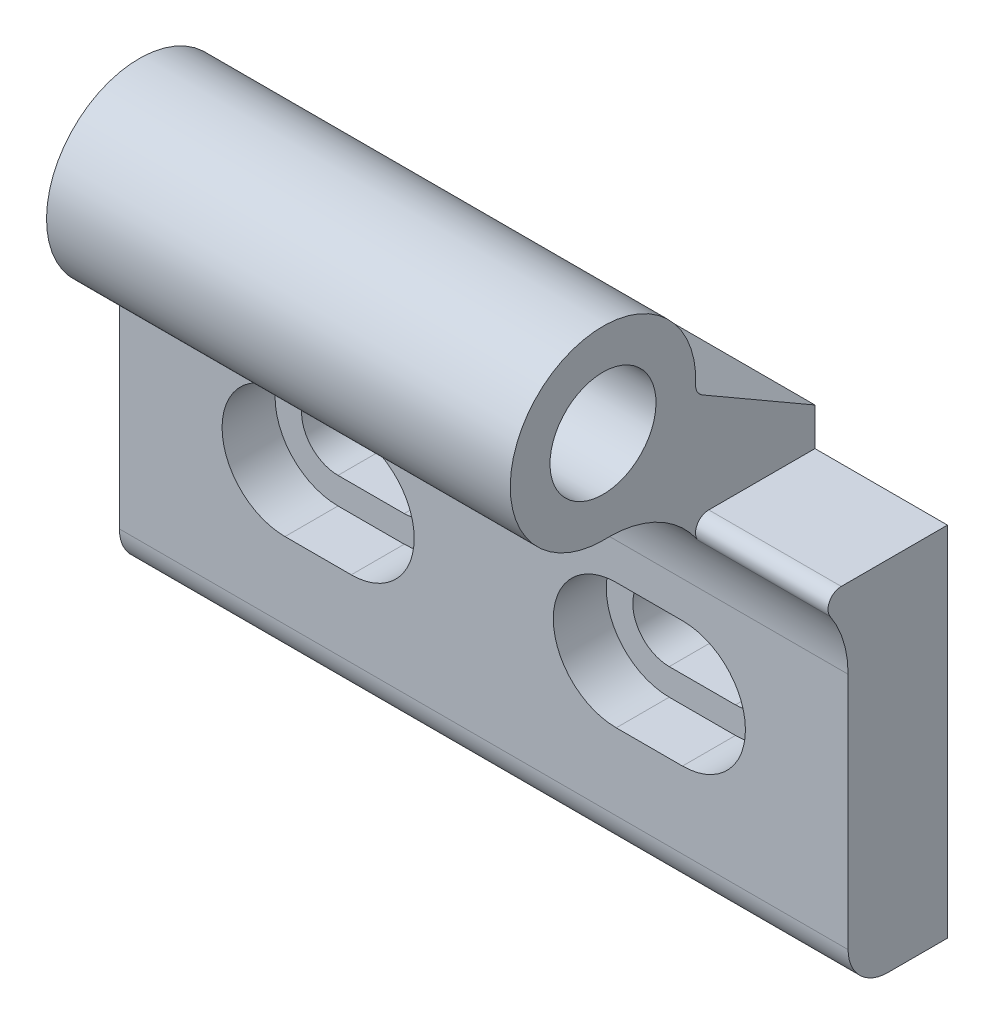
ISO-10303-21;
HEADER;
FILE_DESCRIPTION(('STEP AP214'),'2;1');
FILE_NAME('part.step','',(''),(''),'','','');
FILE_SCHEMA(('AUTOMOTIVE_DESIGN { 1 0 10303 214 1 1 1 1 }'));
ENDSEC;
DATA;
#1=APPLICATION_CONTEXT('core data for automotive mechanical design processes');
#2=APPLICATION_PROTOCOL_DEFINITION('international standard','automotive_design',2000,#1);
#3=PRODUCT_CONTEXT('',#1,'mechanical');
#4=PRODUCT('Part','Part','',(#3));
#5=PRODUCT_RELATED_PRODUCT_CATEGORY('part','',(#4));
#6=PRODUCT_DEFINITION_FORMATION('','',#4);
#7=PRODUCT_DEFINITION_CONTEXT('part definition',#1,'design');
#8=PRODUCT_DEFINITION('design','',#6,#7);
#9=PRODUCT_DEFINITION_SHAPE('','',#8);
#10=(LENGTH_UNIT() NAMED_UNIT(*) SI_UNIT(.MILLI.,.METRE.));
#11=(NAMED_UNIT(*) PLANE_ANGLE_UNIT() SI_UNIT($,.RADIAN.));
#12=(NAMED_UNIT(*) SI_UNIT($,.STERADIAN.) SOLID_ANGLE_UNIT());
#13=UNCERTAINTY_MEASURE_WITH_UNIT(LENGTH_MEASURE(1.E-05),#10,'distance_accuracy_value','');
#14=(GEOMETRIC_REPRESENTATION_CONTEXT(3) GLOBAL_UNCERTAINTY_ASSIGNED_CONTEXT((#13)) GLOBAL_UNIT_ASSIGNED_CONTEXT((#10,
#11,#12)) REPRESENTATION_CONTEXT('',''));
#15=CARTESIAN_POINT('',(0.,0.,0.));
#16=DIRECTION('',(0.,0.,1.));
#17=DIRECTION('',(1.,0.,0.));
#18=AXIS2_PLACEMENT_3D('',#15,#16,#17);
#19=CARTESIAN_POINT('',(42.5,15.5,16.));
#20=DIRECTION('',(0.,-1.,0.));
#21=DIRECTION('',(1.,0.,0.));
#22=AXIS2_PLACEMENT_3D('',#19,#20,#21);
#23=PLANE('',#22);
#24=DIRECTION('',(0.,0.,1.));
#25=VECTOR('',#24,1.);
#26=CARTESIAN_POINT('',(32.5,15.5,16.));
#27=LINE('',#26,#25);
#28=CARTESIAN_POINT('',(32.5,15.5,15.5));
#29=VERTEX_POINT('',#28);
#30=CARTESIAN_POINT('',(32.5,15.5,16.));
#31=VERTEX_POINT('',#30);
#32=EDGE_CURVE('E448',#29,#31,#27,.T.);
#33=ORIENTED_EDGE('',*,*,#32,.T.);
#34=DIRECTION('',(1.,0.,0.));
#35=VECTOR('',#34,1.);
#36=CARTESIAN_POINT('',(42.5,15.5,16.));
#37=LINE('',#36,#35);
#38=CARTESIAN_POINT('',(-2.5,15.5,16.));
#39=VERTEX_POINT('',#38);
#40=EDGE_CURVE('E411',#39,#31,#37,.T.);
#41=ORIENTED_EDGE('',*,*,#40,.F.);
#42=DIRECTION('',(0.,0.,1.));
#43=VECTOR('',#42,1.);
#44=CARTESIAN_POINT('',(-2.5,15.5,16.));
#45=LINE('',#44,#43);
#46=CARTESIAN_POINT('',(-2.5,15.5,15.5));
#47=VERTEX_POINT('',#46);
#48=EDGE_CURVE('E449',#39,#47,#45,.F.);
#49=ORIENTED_EDGE('',*,*,#48,.T.);
#50=DIRECTION('',(1.,0.,0.));
#51=VECTOR('',#50,1.);
#52=CARTESIAN_POINT('',(42.5,15.5,15.5));
#53=LINE('',#52,#51);
#54=EDGE_CURVE('E393',#47,#29,#53,.T.);
#55=ORIENTED_EDGE('',*,*,#54,.T.);
#56=EDGE_LOOP('',(#33,#41,#49,#55));
#57=FACE_BOUND('',#56,.T.);
#58=ADVANCED_FACE('F14',(#57),#23,.T.);
#59=CARTESIAN_POINT('',(25.,0.,3.5));
#60=DIRECTION('',(0.,0.,-1.));
#61=DIRECTION('',(1.,0.,0.));
#62=AXIS2_PLACEMENT_3D('',#59,#60,#61);
#63=CYLINDRICAL_SURFACE('',#62,4.75);
#64=DIRECTION('',(0.,0.,1.));
#65=VECTOR('',#64,1.);
#66=CARTESIAN_POINT('',(25.,-4.75,3.5));
#67=LINE('',#66,#65);
#68=CARTESIAN_POINT('',(25.,-4.75,7.5));
#69=VERTEX_POINT('',#68);
#70=CARTESIAN_POINT('',(25.,-4.75,3.5));
#71=VERTEX_POINT('',#70);
#72=EDGE_CURVE('E230',#69,#71,#67,.F.);
#73=ORIENTED_EDGE('',*,*,#72,.T.);
#74=CARTESIAN_POINT('',(25.,0.,3.5));
#75=DIRECTION('',(0.,0.,-1.));
#76=DIRECTION('',(1.,0.,0.));
#77=AXIS2_PLACEMENT_3D('',#74,#75,#76);
#78=CIRCLE('',#77,4.75);
#79=CARTESIAN_POINT('',(25.,4.75,3.5));
#80=VERTEX_POINT('',#79);
#81=EDGE_CURVE('E239',#80,#71,#78,.F.);
#82=ORIENTED_EDGE('',*,*,#81,.F.);
#83=DIRECTION('',(0.,0.,1.));
#84=VECTOR('',#83,1.);
#85=CARTESIAN_POINT('',(25.,4.75,3.5));
#86=LINE('',#85,#84);
#87=CARTESIAN_POINT('',(25.,4.75,7.5));
#88=VERTEX_POINT('',#87);
#89=EDGE_CURVE('E231',#80,#88,#86,.T.);
#90=ORIENTED_EDGE('',*,*,#89,.T.);
#91=CARTESIAN_POINT('',(25.,0.,7.5));
#92=DIRECTION('',(0.,0.,-1.));
#93=DIRECTION('',(1.,0.,0.));
#94=AXIS2_PLACEMENT_3D('',#91,#92,#93);
#95=CIRCLE('',#94,4.75);
#96=EDGE_CURVE('E271',#69,#88,#95,.T.);
#97=ORIENTED_EDGE('',*,*,#96,.F.);
#98=EDGE_LOOP('',(#73,#82,#90,#97));
#99=FACE_BOUND('',#98,.T.);
#100=ADVANCED_FACE('F508',(#99),#63,.F.);
#101=CARTESIAN_POINT('',(25.,4.75,3.5));
#102=DIRECTION('',(0.,1.,0.));
#103=DIRECTION('',(-1.,0.,0.));
#104=AXIS2_PLACEMENT_3D('',#101,#102,#103);
#105=PLANE('',#104);
#106=ORIENTED_EDGE('',*,*,#89,.F.);
#107=DIRECTION('',(-1.,0.,0.));
#108=VECTOR('',#107,1.);
#109=CARTESIAN_POINT('',(15.,4.75,3.5));
#110=LINE('',#109,#108);
#111=CARTESIAN_POINT('',(30.,4.75,3.5));
#112=VERTEX_POINT('',#111);
#113=EDGE_CURVE('E234',#112,#80,#110,.T.);
#114=ORIENTED_EDGE('',*,*,#113,.F.);
#115=DIRECTION('',(0.,0.,-1.));
#116=VECTOR('',#115,1.);
#117=CARTESIAN_POINT('',(30.,4.75,3.5));
#118=LINE('',#117,#116);
#119=CARTESIAN_POINT('',(30.,4.75,7.5));
#120=VERTEX_POINT('',#119);
#121=EDGE_CURVE('E220',#112,#120,#118,.F.);
#122=ORIENTED_EDGE('',*,*,#121,.T.);
#123=DIRECTION('',(-1.,0.,0.));
#124=VECTOR('',#123,1.);
#125=CARTESIAN_POINT('',(42.5,4.75,7.5));
#126=LINE('',#125,#124);
#127=EDGE_CURVE('E269',#88,#120,#126,.F.);
#128=ORIENTED_EDGE('',*,*,#127,.F.);
#129=EDGE_LOOP('',(#106,#114,#122,#128));
#130=FACE_BOUND('',#129,.T.);
#131=ADVANCED_FACE('F235',(#130),#105,.F.);
#132=CARTESIAN_POINT('',(30.,0.,3.5));
#133=DIRECTION('',(0.,0.,-1.));
#134=DIRECTION('',(1.,0.,0.));
#135=AXIS2_PLACEMENT_3D('',#132,#133,#134);
#136=CYLINDRICAL_SURFACE('',#135,4.75);
#137=ORIENTED_EDGE('',*,*,#121,.F.);
#138=CARTESIAN_POINT('',(30.,0.,3.5));
#139=DIRECTION('',(0.,0.,-1.));
#140=DIRECTION('',(1.,0.,0.));
#141=AXIS2_PLACEMENT_3D('',#138,#139,#140);
#142=CIRCLE('',#141,4.75);
#143=CARTESIAN_POINT('',(30.,-4.75,3.5));
#144=VERTEX_POINT('',#143);
#145=EDGE_CURVE('E18',#144,#112,#142,.F.);
#146=ORIENTED_EDGE('',*,*,#145,.F.);
#147=DIRECTION('',(0.,0.,1.));
#148=VECTOR('',#147,1.);
#149=CARTESIAN_POINT('',(30.,-4.75,3.5));
#150=LINE('',#149,#148);
#151=CARTESIAN_POINT('',(30.,-4.75,7.5));
#152=VERTEX_POINT('',#151);
#153=EDGE_CURVE('E215',#144,#152,#150,.T.);
#154=ORIENTED_EDGE('',*,*,#153,.T.);
#155=CARTESIAN_POINT('',(30.,0.,7.5));
#156=DIRECTION('',(0.,0.,-1.));
#157=DIRECTION('',(1.,0.,0.));
#158=AXIS2_PLACEMENT_3D('',#155,#156,#157);
#159=CIRCLE('',#158,4.75);
#160=EDGE_CURVE('E226',#120,#152,#159,.T.);
#161=ORIENTED_EDGE('',*,*,#160,.F.);
#162=EDGE_LOOP('',(#137,#146,#154,#161));
#163=FACE_BOUND('',#162,.T.);
#164=ADVANCED_FACE('F222',(#163),#136,.F.);
#165=CARTESIAN_POINT('',(30.,-4.75,3.5));
#166=DIRECTION('',(0.,-1.,0.));
#167=DIRECTION('',(1.,0.,0.));
#168=AXIS2_PLACEMENT_3D('',#165,#166,#167);
#169=PLANE('',#168);
#170=ORIENTED_EDGE('',*,*,#153,.F.);
#171=DIRECTION('',(-1.,0.,0.));
#172=VECTOR('',#171,1.);
#173=CARTESIAN_POINT('',(15.,-4.75,3.5));
#174=LINE('',#173,#172);
#175=EDGE_CURVE('E243',#71,#144,#174,.F.);
#176=ORIENTED_EDGE('',*,*,#175,.F.);
#177=ORIENTED_EDGE('',*,*,#72,.F.);
#178=DIRECTION('',(-1.,0.,0.));
#179=VECTOR('',#178,1.);
#180=CARTESIAN_POINT('',(42.5,-4.75,7.5));
#181=LINE('',#180,#179);
#182=EDGE_CURVE('E266',#152,#69,#181,.T.);
#183=ORIENTED_EDGE('',*,*,#182,.F.);
#184=EDGE_LOOP('',(#170,#176,#177,#183));
#185=FACE_BOUND('',#184,.T.);
#186=ADVANCED_FACE('F510',(#185),#169,.F.);
#187=CARTESIAN_POINT('',(0.,0.,3.5));
#188=DIRECTION('',(0.,0.,-1.));
#189=DIRECTION('',(1.,0.,0.));
#190=AXIS2_PLACEMENT_3D('',#187,#188,#189);
#191=CYLINDRICAL_SURFACE('',#190,4.75);
#192=DIRECTION('',(0.,0.,1.));
#193=VECTOR('',#192,1.);
#194=CARTESIAN_POINT('',(0.,-4.75,3.5));
#195=LINE('',#194,#193);
#196=CARTESIAN_POINT('',(0.,-4.75,7.5));
#197=VERTEX_POINT('',#196);
#198=CARTESIAN_POINT('',(0.,-4.75,3.5));
#199=VERTEX_POINT('',#198);
#200=EDGE_CURVE('E246',#197,#199,#195,.F.);
#201=ORIENTED_EDGE('',*,*,#200,.T.);
#202=CARTESIAN_POINT('',(0.,0.,3.5));
#203=DIRECTION('',(0.,0.,-1.));
#204=DIRECTION('',(1.,0.,0.));
#205=AXIS2_PLACEMENT_3D('',#202,#203,#204);
#206=CIRCLE('',#205,4.75);
#207=CARTESIAN_POINT('',(0.,4.75,3.5));
#208=VERTEX_POINT('',#207);
#209=EDGE_CURVE('E252',#208,#199,#206,.F.);
#210=ORIENTED_EDGE('',*,*,#209,.F.);
#211=DIRECTION('',(0.,0.,1.));
#212=VECTOR('',#211,1.);
#213=CARTESIAN_POINT('',(0.,4.75,3.5));
#214=LINE('',#213,#212);
#215=CARTESIAN_POINT('',(0.,4.75,7.5));
#216=VERTEX_POINT('',#215);
#217=EDGE_CURVE('E443',#208,#216,#214,.T.);
#218=ORIENTED_EDGE('',*,*,#217,.T.);
#219=CARTESIAN_POINT('',(0.,0.,7.5));
#220=DIRECTION('',(0.,0.,-1.));
#221=DIRECTION('',(1.,0.,0.));
#222=AXIS2_PLACEMENT_3D('',#219,#220,#221);
#223=CIRCLE('',#222,4.75);
#224=EDGE_CURVE('E265',#197,#216,#223,.T.);
#225=ORIENTED_EDGE('',*,*,#224,.F.);
#226=EDGE_LOOP('',(#201,#210,#218,#225));
#227=FACE_BOUND('',#226,.T.);
#228=ADVANCED_FACE('F512',(#227),#191,.F.);
#229=CARTESIAN_POINT('',(0.,4.75,3.5));
#230=DIRECTION('',(0.,1.,0.));
#231=DIRECTION('',(-1.,0.,0.));
#232=AXIS2_PLACEMENT_3D('',#229,#230,#231);
#233=PLANE('',#232);
#234=ORIENTED_EDGE('',*,*,#217,.F.);
#235=DIRECTION('',(-1.,0.,0.));
#236=VECTOR('',#235,1.);
#237=CARTESIAN_POINT('',(15.,4.75,3.5));
#238=LINE('',#237,#236);
#239=CARTESIAN_POINT('',(5.,4.75,3.5));
#240=VERTEX_POINT('',#239);
#241=EDGE_CURVE('E249',#240,#208,#238,.T.);
#242=ORIENTED_EDGE('',*,*,#241,.F.);
#243=DIRECTION('',(0.,0.,-1.));
#244=VECTOR('',#243,1.);
#245=CARTESIAN_POINT('',(5.,4.75,3.5));
#246=LINE('',#245,#244);
#247=CARTESIAN_POINT('',(5.,4.75,7.5));
#248=VERTEX_POINT('',#247);
#249=EDGE_CURVE('E441',#240,#248,#246,.F.);
#250=ORIENTED_EDGE('',*,*,#249,.T.);
#251=DIRECTION('',(-1.,0.,0.));
#252=VECTOR('',#251,1.);
#253=CARTESIAN_POINT('',(42.5,4.75,7.5));
#254=LINE('',#253,#252);
#255=EDGE_CURVE('E262',#216,#248,#254,.F.);
#256=ORIENTED_EDGE('',*,*,#255,.F.);
#257=EDGE_LOOP('',(#234,#242,#250,#256));
#258=FACE_BOUND('',#257,.T.);
#259=ADVANCED_FACE('F520',(#258),#233,.F.);
#260=CARTESIAN_POINT('',(5.,0.,3.5));
#261=DIRECTION('',(0.,0.,-1.));
#262=DIRECTION('',(1.,0.,0.));
#263=AXIS2_PLACEMENT_3D('',#260,#261,#262);
#264=CYLINDRICAL_SURFACE('',#263,4.75);
#265=ORIENTED_EDGE('',*,*,#249,.F.);
#266=CARTESIAN_POINT('',(5.,0.,3.5));
#267=DIRECTION('',(0.,0.,-1.));
#268=DIRECTION('',(1.,0.,0.));
#269=AXIS2_PLACEMENT_3D('',#266,#267,#268);
#270=CIRCLE('',#269,4.75);
#271=CARTESIAN_POINT('',(5.,-4.75,3.5));
#272=VERTEX_POINT('',#271);
#273=EDGE_CURVE('E253',#272,#240,#270,.F.);
#274=ORIENTED_EDGE('',*,*,#273,.F.);
#275=DIRECTION('',(0.,0.,1.));
#276=VECTOR('',#275,1.);
#277=CARTESIAN_POINT('',(5.,-4.75,3.5));
#278=LINE('',#277,#276);
#279=CARTESIAN_POINT('',(5.,-4.75,7.5));
#280=VERTEX_POINT('',#279);
#281=EDGE_CURVE('E244',#272,#280,#278,.T.);
#282=ORIENTED_EDGE('',*,*,#281,.T.);
#283=CARTESIAN_POINT('',(5.,0.,7.5));
#284=DIRECTION('',(0.,0.,-1.));
#285=DIRECTION('',(1.,0.,0.));
#286=AXIS2_PLACEMENT_3D('',#283,#284,#285);
#287=CIRCLE('',#286,4.75);
#288=EDGE_CURVE('E261',#248,#280,#287,.T.);
#289=ORIENTED_EDGE('',*,*,#288,.F.);
#290=EDGE_LOOP('',(#265,#274,#282,#289));
#291=FACE_BOUND('',#290,.T.);
#292=ADVANCED_FACE('F564',(#291),#264,.F.);
#293=CARTESIAN_POINT('',(5.,-4.75,3.5));
#294=DIRECTION('',(0.,-1.,0.));
#295=DIRECTION('',(1.,0.,0.));
#296=AXIS2_PLACEMENT_3D('',#293,#294,#295);
#297=PLANE('',#296);
#298=ORIENTED_EDGE('',*,*,#281,.F.);
#299=DIRECTION('',(-1.,0.,0.));
#300=VECTOR('',#299,1.);
#301=CARTESIAN_POINT('',(15.,-4.75,3.5));
#302=LINE('',#301,#300);
#303=EDGE_CURVE('E254',#199,#272,#302,.F.);
#304=ORIENTED_EDGE('',*,*,#303,.F.);
#305=ORIENTED_EDGE('',*,*,#200,.F.);
#306=DIRECTION('',(-1.,0.,0.));
#307=VECTOR('',#306,1.);
#308=CARTESIAN_POINT('',(42.5,-4.75,7.5));
#309=LINE('',#308,#307);
#310=EDGE_CURVE('E257',#280,#197,#309,.T.);
#311=ORIENTED_EDGE('',*,*,#310,.F.);
#312=EDGE_LOOP('',(#298,#304,#305,#311));
#313=FACE_BOUND('',#312,.T.);
#314=ADVANCED_FACE('F554',(#313),#297,.F.);
#315=CARTESIAN_POINT('',(15.,22.5,3.5));
#316=DIRECTION('',(0.,0.,1.));
#317=DIRECTION('',(-1.,0.,0.));
#318=AXIS2_PLACEMENT_3D('',#315,#316,#317);
#319=PLANE('',#318);
#320=ORIENTED_EDGE('',*,*,#113,.T.);
#321=ORIENTED_EDGE('',*,*,#81,.T.);
#322=ORIENTED_EDGE('',*,*,#175,.T.);
#323=ORIENTED_EDGE('',*,*,#145,.T.);
#324=EDGE_LOOP('',(#320,#321,#322,#323));
#325=FACE_BOUND('',#324,.T.);
#326=CARTESIAN_POINT('',(25.,0.,3.5));
#327=DIRECTION('',(0.,0.,-1.));
#328=DIRECTION('',(1.,0.,0.));
#329=AXIS2_PLACEMENT_3D('',#326,#327,#328);
#330=CIRCLE('',#329,2.75);
#331=CARTESIAN_POINT('',(25.,-2.75,3.5));
#332=VERTEX_POINT('',#331);
#333=CARTESIAN_POINT('',(25.,2.75,3.5));
#334=VERTEX_POINT('',#333);
#335=EDGE_CURVE('E342',#332,#334,#330,.T.);
#336=ORIENTED_EDGE('',*,*,#335,.T.);
#337=DIRECTION('',(-1.,0.,0.));
#338=VECTOR('',#337,1.);
#339=CARTESIAN_POINT('',(25.,2.75,3.5));
#340=LINE('',#339,#338);
#341=CARTESIAN_POINT('',(30.,2.75,3.5));
#342=VERTEX_POINT('',#341);
#343=EDGE_CURVE('E336',#334,#342,#340,.F.);
#344=ORIENTED_EDGE('',*,*,#343,.T.);
#345=CARTESIAN_POINT('',(30.,0.,3.5));
#346=DIRECTION('',(0.,0.,-1.));
#347=DIRECTION('',(1.,0.,0.));
#348=AXIS2_PLACEMENT_3D('',#345,#346,#347);
#349=CIRCLE('',#348,2.75);
#350=CARTESIAN_POINT('',(30.,-2.75,3.5));
#351=VERTEX_POINT('',#350);
#352=EDGE_CURVE('E333',#342,#351,#349,.T.);
#353=ORIENTED_EDGE('',*,*,#352,.T.);
#354=DIRECTION('',(1.,0.,0.));
#355=VECTOR('',#354,1.);
#356=CARTESIAN_POINT('',(30.,-2.75,3.5));
#357=LINE('',#356,#355);
#358=EDGE_CURVE('E339',#351,#332,#357,.F.);
#359=ORIENTED_EDGE('',*,*,#358,.T.);
#360=EDGE_LOOP('',(#336,#344,#353,#359));
#361=FACE_BOUND('',#360,.T.);
#362=ADVANCED_FACE('F241',(#325,#361),#319,.T.);
#363=CARTESIAN_POINT('',(15.,22.5,3.5));
#364=DIRECTION('',(0.,0.,1.));
#365=DIRECTION('',(-1.,0.,0.));
#366=AXIS2_PLACEMENT_3D('',#363,#364,#365);
#367=PLANE('',#366);
#368=ORIENTED_EDGE('',*,*,#241,.T.);
#369=ORIENTED_EDGE('',*,*,#209,.T.);
#370=ORIENTED_EDGE('',*,*,#303,.T.);
#371=ORIENTED_EDGE('',*,*,#273,.T.);
#372=EDGE_LOOP('',(#368,#369,#370,#371));
#373=FACE_BOUND('',#372,.T.);
#374=CARTESIAN_POINT('',(0.,0.,3.5));
#375=DIRECTION('',(0.,0.,-1.));
#376=DIRECTION('',(1.,0.,0.));
#377=AXIS2_PLACEMENT_3D('',#374,#375,#376);
#378=CIRCLE('',#377,2.75);
#379=CARTESIAN_POINT('',(0.,-2.75,3.5));
#380=VERTEX_POINT('',#379);
#381=CARTESIAN_POINT('',(0.,2.75,3.5));
#382=VERTEX_POINT('',#381);
#383=EDGE_CURVE('E329',#380,#382,#378,.T.);
#384=ORIENTED_EDGE('',*,*,#383,.T.);
#385=DIRECTION('',(-1.,0.,0.));
#386=VECTOR('',#385,1.);
#387=CARTESIAN_POINT('',(0.,2.75,3.5));
#388=LINE('',#387,#386);
#389=CARTESIAN_POINT('',(5.,2.75,3.5));
#390=VERTEX_POINT('',#389);
#391=EDGE_CURVE('E323',#382,#390,#388,.F.);
#392=ORIENTED_EDGE('',*,*,#391,.T.);
#393=CARTESIAN_POINT('',(5.,0.,3.5));
#394=DIRECTION('',(0.,0.,-1.));
#395=DIRECTION('',(1.,0.,0.));
#396=AXIS2_PLACEMENT_3D('',#393,#394,#395);
#397=CIRCLE('',#396,2.75);
#398=CARTESIAN_POINT('',(5.,-2.75,3.5));
#399=VERTEX_POINT('',#398);
#400=EDGE_CURVE('E320',#390,#399,#397,.T.);
#401=ORIENTED_EDGE('',*,*,#400,.T.);
#402=DIRECTION('',(1.,0.,0.));
#403=VECTOR('',#402,1.);
#404=CARTESIAN_POINT('',(5.,-2.75,3.5));
#405=LINE('',#404,#403);
#406=EDGE_CURVE('E326',#399,#380,#405,.F.);
#407=ORIENTED_EDGE('',*,*,#406,.T.);
#408=EDGE_LOOP('',(#384,#392,#401,#407));
#409=FACE_BOUND('',#408,.T.);
#410=ADVANCED_FACE('F553',(#373,#409),#367,.T.);
#411=CARTESIAN_POINT('',(42.5,22.1284858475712,8.00863107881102));
#412=DIRECTION('',(1.,0.,0.));
#413=DIRECTION('',(0.,1.,0.));
#414=AXIS2_PLACEMENT_3D('',#411,#412,#413);
#415=CYLINDRICAL_SURFACE('',#414,1.);
#416=DIRECTION('',(1.,0.,0.));
#417=VECTOR('',#416,1.);
#418=CARTESIAN_POINT('',(42.5,22.1749250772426,9.0075521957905));
#419=LINE('',#418,#417);
#420=CARTESIAN_POINT('',(32.5,22.1749250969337,9.00755219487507));
#421=VERTEX_POINT('',#420);
#422=CARTESIAN_POINT('',(-2.5,22.1749250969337,9.00755219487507));
#423=VERTEX_POINT('',#422);
#424=EDGE_CURVE('E414',#421,#423,#419,.F.);
#425=ORIENTED_EDGE('',*,*,#424,.F.);
#426=CARTESIAN_POINT('',(32.5,22.1284858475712,8.00863107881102));
#427=DIRECTION('',(1.,0.,0.));
#428=DIRECTION('',(0.,1.,0.));
#429=AXIS2_PLACEMENT_3D('',#426,#427,#428);
#430=CIRCLE('',#429,1.);
#431=CARTESIAN_POINT('',(32.5,21.2624604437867,8.50863107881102));
#432=VERTEX_POINT('',#431);
#433=EDGE_CURVE('E417',#432,#421,#430,.F.);
#434=ORIENTED_EDGE('',*,*,#433,.F.);
#435=DIRECTION('',(-1.,0.,0.));
#436=VECTOR('',#435,1.);
#437=CARTESIAN_POINT('',(42.5,21.2624604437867,8.50863107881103));
#438=LINE('',#437,#436);
#439=CARTESIAN_POINT('',(-2.5,21.2624604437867,8.50863107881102));
#440=VERTEX_POINT('',#439);
#441=EDGE_CURVE('E418',#440,#432,#438,.F.);
#442=ORIENTED_EDGE('',*,*,#441,.F.);
#443=CARTESIAN_POINT('',(-2.5,22.1284858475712,8.00863107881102));
#444=DIRECTION('',(1.,0.,0.));
#445=DIRECTION('',(0.,1.,0.));
#446=AXIS2_PLACEMENT_3D('',#443,#444,#445);
#447=CIRCLE('',#446,1.);
#448=EDGE_CURVE('E484',#440,#423,#447,.F.);
#449=ORIENTED_EDGE('',*,*,#448,.T.);
#450=EDGE_LOOP('',(#425,#434,#442,#449));
#451=FACE_BOUND('',#450,.T.);
#452=ADVANCED_FACE('F561',(#451),#415,.F.);
#453=CARTESIAN_POINT('',(42.5,22.5,16.));
#454=DIRECTION('',(1.,0.,0.));
#455=DIRECTION('',(0.,1.,0.));
#456=AXIS2_PLACEMENT_3D('',#453,#454,#455);
#457=CYLINDRICAL_SURFACE('',#456,4.);
#458=CARTESIAN_POINT('',(32.5,22.5,16.));
#459=DIRECTION('',(1.,0.,0.));
#460=DIRECTION('',(0.,1.,0.));
#461=AXIS2_PLACEMENT_3D('',#458,#459,#460);
#462=CIRCLE('',#461,4.);
#463=CARTESIAN_POINT('',(32.5,26.5,16.));
#464=VERTEX_POINT('',#463);
#465=EDGE_CURVE('E276',#464,#464,#462,.F.);
#466=ORIENTED_EDGE('',*,*,#465,.F.);
#467=EDGE_LOOP('',(#466));
#468=FACE_BOUND('',#467,.T.);
#469=CARTESIAN_POINT('',(-2.5,22.5,16.));
#470=DIRECTION('',(1.,0.,0.));
#471=DIRECTION('',(0.,1.,0.));
#472=AXIS2_PLACEMENT_3D('',#469,#470,#471);
#473=CIRCLE('',#472,4.);
#474=CARTESIAN_POINT('',(-2.5,26.5,16.));
#475=VERTEX_POINT('',#474);
#476=EDGE_CURVE('E433',#475,#475,#473,.F.);
#477=ORIENTED_EDGE('',*,*,#476,.T.);
#478=EDGE_LOOP('',(#477));
#479=FACE_BOUND('',#478,.T.);
#480=ADVANCED_FACE('F571',(#468,#479),#457,.F.);
#481=CARTESIAN_POINT('',(42.5,22.5,16.));
#482=DIRECTION('',(1.,0.,0.));
#483=DIRECTION('',(0.,1.,0.));
#484=AXIS2_PLACEMENT_3D('',#481,#482,#483);
#485=CYLINDRICAL_SURFACE('',#484,7.);
#486=ORIENTED_EDGE('',*,*,#40,.T.);
#487=CARTESIAN_POINT('',(32.5,22.5,16.));
#488=DIRECTION('',(1.,0.,0.));
#489=DIRECTION('',(0.,1.,0.));
#490=AXIS2_PLACEMENT_3D('',#487,#488,#489);
#491=CIRCLE('',#490,7.);
#492=EDGE_CURVE('E275',#421,#31,#491,.T.);
#493=ORIENTED_EDGE('',*,*,#492,.F.);
#494=ORIENTED_EDGE('',*,*,#424,.T.);
#495=CARTESIAN_POINT('',(-2.5,22.5,16.));
#496=DIRECTION('',(1.,0.,0.));
#497=DIRECTION('',(0.,1.,0.));
#498=AXIS2_PLACEMENT_3D('',#495,#496,#497);
#499=CIRCLE('',#498,7.);
#500=EDGE_CURVE('E481',#423,#39,#499,.T.);
#501=ORIENTED_EDGE('',*,*,#500,.T.);
#502=EDGE_LOOP('',(#486,#493,#494,#501));
#503=FACE_BOUND('',#502,.T.);
#504=ADVANCED_FACE('F575',(#503),#485,.T.);
#505=CARTESIAN_POINT('',(42.5,12.5,8.01668522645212));
#506=DIRECTION('',(1.,0.,0.));
#507=DIRECTION('',(0.,1.,0.));
#508=AXIS2_PLACEMENT_3D('',#505,#506,#507);
#509=CYLINDRICAL_SURFACE('',#508,1.);
#510=CARTESIAN_POINT('',(42.5,12.5,8.01668522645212));
#511=DIRECTION('',(1.,0.,0.));
#512=DIRECTION('',(0.,1.,0.));
#513=AXIS2_PLACEMENT_3D('',#510,#511,#512);
#514=CIRCLE('',#513,1.);
#515=CARTESIAN_POINT('',(42.5,13.5,8.01668522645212));
#516=VERTEX_POINT('',#515);
#517=CARTESIAN_POINT('',(42.5,11.9444444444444,8.84816464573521));
#518=VERTEX_POINT('',#517);
#519=EDGE_CURVE('E287',#516,#518,#514,.T.);
#520=ORIENTED_EDGE('',*,*,#519,.F.);
#521=DIRECTION('',(-1.,0.,0.));
#522=VECTOR('',#521,1.);
#523=CARTESIAN_POINT('',(42.5,13.5,8.01668522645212));
#524=LINE('',#523,#522);
#525=CARTESIAN_POINT('',(32.5,13.5,8.01668522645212));
#526=VERTEX_POINT('',#525);
#527=EDGE_CURVE('E394',#516,#526,#524,.T.);
#528=ORIENTED_EDGE('',*,*,#527,.T.);
#529=CARTESIAN_POINT('',(32.5,12.5,8.01668522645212));
#530=DIRECTION('',(1.,0.,0.));
#531=DIRECTION('',(0.,1.,0.));
#532=AXIS2_PLACEMENT_3D('',#529,#530,#531);
#533=CIRCLE('',#532,1.);
#534=CARTESIAN_POINT('',(32.5,11.9444444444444,8.84816464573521));
#535=VERTEX_POINT('',#534);
#536=EDGE_CURVE('E396',#535,#526,#533,.F.);
#537=ORIENTED_EDGE('',*,*,#536,.F.);
#538=DIRECTION('',(1.,0.,0.));
#539=VECTOR('',#538,1.);
#540=CARTESIAN_POINT('',(42.5,11.9444444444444,8.8481646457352));
#541=LINE('',#540,#539);
#542=EDGE_CURVE('E391',#535,#518,#541,.T.);
#543=ORIENTED_EDGE('',*,*,#542,.T.);
#544=EDGE_LOOP('',(#520,#528,#537,#543));
#545=FACE_BOUND('',#544,.T.);
#546=ADVANCED_FACE('F579',(#545),#509,.T.);
#547=CARTESIAN_POINT('',(42.5,7.5,15.5));
#548=DIRECTION('',(1.,0.,0.));
#549=DIRECTION('',(0.,1.,0.));
#550=AXIS2_PLACEMENT_3D('',#547,#548,#549);
#551=CYLINDRICAL_SURFACE('',#550,8.);
#552=DIRECTION('',(-1.,0.,0.));
#553=VECTOR('',#552,1.);
#554=CARTESIAN_POINT('',(-12.5,11.9444444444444,8.8481646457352));
#555=LINE('',#554,#553);
#556=CARTESIAN_POINT('',(-12.5,11.9444444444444,8.84816464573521));
#557=VERTEX_POINT('',#556);
#558=CARTESIAN_POINT('',(-2.5,11.9444444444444,8.84816464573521));
#559=VERTEX_POINT('',#558);
#560=EDGE_CURVE('E377',#557,#559,#555,.F.);
#561=ORIENTED_EDGE('',*,*,#560,.F.);
#562=CARTESIAN_POINT('',(-12.5,7.5,15.5));
#563=DIRECTION('',(1.,0.,0.));
#564=DIRECTION('',(0.,1.,0.));
#565=AXIS2_PLACEMENT_3D('',#562,#563,#564);
#566=CIRCLE('',#565,8.);
#567=CARTESIAN_POINT('',(-12.5,7.5,7.5));
#568=VERTEX_POINT('',#567);
#569=EDGE_CURVE('E299',#557,#568,#566,.F.);
#570=ORIENTED_EDGE('',*,*,#569,.T.);
#571=DIRECTION('',(-1.,0.,0.));
#572=VECTOR('',#571,1.);
#573=CARTESIAN_POINT('',(42.5,7.5,7.5));
#574=LINE('',#573,#572);
#575=CARTESIAN_POINT('',(42.5,7.5,7.5));
#576=VERTEX_POINT('',#575);
#577=EDGE_CURVE('E260',#576,#568,#574,.T.);
#578=ORIENTED_EDGE('',*,*,#577,.F.);
#579=CARTESIAN_POINT('',(42.5,7.5,15.5));
#580=DIRECTION('',(1.,0.,0.));
#581=DIRECTION('',(0.,1.,0.));
#582=AXIS2_PLACEMENT_3D('',#579,#580,#581);
#583=CIRCLE('',#582,8.);
#584=EDGE_CURVE('E283',#518,#576,#583,.F.);
#585=ORIENTED_EDGE('',*,*,#584,.F.);
#586=ORIENTED_EDGE('',*,*,#542,.F.);
#587=CARTESIAN_POINT('',(32.5,7.5,15.5));
#588=DIRECTION('',(1.,0.,0.));
#589=DIRECTION('',(0.,1.,0.));
#590=AXIS2_PLACEMENT_3D('',#587,#588,#589);
#591=CIRCLE('',#590,8.);
#592=EDGE_CURVE('E471',#29,#535,#591,.F.);
#593=ORIENTED_EDGE('',*,*,#592,.F.);
#594=ORIENTED_EDGE('',*,*,#54,.F.);
#595=CARTESIAN_POINT('',(-2.5,7.5,15.5));
#596=DIRECTION('',(1.,0.,0.));
#597=DIRECTION('',(0.,1.,0.));
#598=AXIS2_PLACEMENT_3D('',#595,#596,#597);
#599=CIRCLE('',#598,8.);
#600=EDGE_CURVE('E479',#47,#559,#599,.F.);
#601=ORIENTED_EDGE('',*,*,#600,.T.);
#602=EDGE_LOOP('',(#561,#570,#578,#585,#586,#593,#594,#601));
#603=FACE_BOUND('',#602,.T.);
#604=ADVANCED_FACE('F583',(#603),#551,.F.);
#605=CARTESIAN_POINT('',(42.5,7.5,7.5));
#606=DIRECTION('',(0.,0.,1.));
#607=DIRECTION('',(-1.,0.,0.));
#608=AXIS2_PLACEMENT_3D('',#605,#606,#607);
#609=PLANE('',#608);
#610=ORIENTED_EDGE('',*,*,#577,.T.);
#611=DIRECTION('',(0.,1.,0.));
#612=VECTOR('',#611,1.);
#613=CARTESIAN_POINT('',(-12.5,22.5,7.5));
#614=LINE('',#613,#612);
#615=CARTESIAN_POINT('',(-12.5,-10.5,7.5));
#616=VERTEX_POINT('',#615);
#617=EDGE_CURVE('E297',#568,#616,#614,.F.);
#618=ORIENTED_EDGE('',*,*,#617,.T.);
#619=DIRECTION('',(1.,0.,0.));
#620=VECTOR('',#619,1.);
#621=CARTESIAN_POINT('',(42.5,-10.5,7.5));
#622=LINE('',#621,#620);
#623=CARTESIAN_POINT('',(42.5,-10.5,7.5));
#624=VERTEX_POINT('',#623);
#625=EDGE_CURVE('E374',#624,#616,#622,.F.);
#626=ORIENTED_EDGE('',*,*,#625,.F.);
#627=DIRECTION('',(0.,1.,0.));
#628=VECTOR('',#627,1.);
#629=CARTESIAN_POINT('',(42.5,22.5,7.5));
#630=LINE('',#629,#628);
#631=EDGE_CURVE('E279',#576,#624,#630,.F.);
#632=ORIENTED_EDGE('',*,*,#631,.F.);
#633=EDGE_LOOP('',(#610,#618,#626,#632));
#634=FACE_BOUND('',#633,.T.);
#635=ORIENTED_EDGE('',*,*,#288,.T.);
#636=ORIENTED_EDGE('',*,*,#310,.T.);
#637=ORIENTED_EDGE('',*,*,#224,.T.);
#638=ORIENTED_EDGE('',*,*,#255,.T.);
#639=EDGE_LOOP('',(#635,#636,#637,#638));
#640=FACE_BOUND('',#639,.T.);
#641=ORIENTED_EDGE('',*,*,#160,.T.);
#642=ORIENTED_EDGE('',*,*,#182,.T.);
#643=ORIENTED_EDGE('',*,*,#96,.T.);
#644=ORIENTED_EDGE('',*,*,#127,.T.);
#645=EDGE_LOOP('',(#641,#642,#643,#644));
#646=FACE_BOUND('',#645,.T.);
#647=ADVANCED_FACE('F587',(#634,#640,#646),#609,.T.);
#648=CARTESIAN_POINT('',(42.5,-10.5,4.5));
#649=DIRECTION('',(1.,0.,0.));
#650=DIRECTION('',(0.,1.,0.));
#651=AXIS2_PLACEMENT_3D('',#648,#649,#650);
#652=CYLINDRICAL_SURFACE('',#651,3.);
#653=CARTESIAN_POINT('',(42.5,-10.5,4.5));
#654=DIRECTION('',(1.,0.,0.));
#655=DIRECTION('',(0.,1.,0.));
#656=AXIS2_PLACEMENT_3D('',#653,#654,#655);
#657=CIRCLE('',#656,3.);
#658=CARTESIAN_POINT('',(42.5,-13.5,4.5));
#659=VERTEX_POINT('',#658);
#660=EDGE_CURVE('E282',#624,#659,#657,.T.);
#661=ORIENTED_EDGE('',*,*,#660,.F.);
#662=ORIENTED_EDGE('',*,*,#625,.T.);
#663=CARTESIAN_POINT('',(-12.5,-10.5,4.5));
#664=DIRECTION('',(1.,0.,0.));
#665=DIRECTION('',(0.,1.,0.));
#666=AXIS2_PLACEMENT_3D('',#663,#664,#665);
#667=CIRCLE('',#666,3.);
#668=CARTESIAN_POINT('',(-12.5,-13.5,4.5));
#669=VERTEX_POINT('',#668);
#670=EDGE_CURVE('E294',#616,#669,#667,.T.);
#671=ORIENTED_EDGE('',*,*,#670,.T.);
#672=DIRECTION('',(1.,0.,0.));
#673=VECTOR('',#672,1.);
#674=CARTESIAN_POINT('',(42.5,-13.5,4.5));
#675=LINE('',#674,#673);
#676=EDGE_CURVE('E364',#659,#669,#675,.F.);
#677=ORIENTED_EDGE('',*,*,#676,.F.);
#678=EDGE_LOOP('',(#661,#662,#671,#677));
#679=FACE_BOUND('',#678,.T.);
#680=ADVANCED_FACE('F591',(#679),#652,.T.);
#681=CARTESIAN_POINT('',(-12.5,12.5,8.01668522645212));
#682=DIRECTION('',(-1.,0.,0.));
#683=DIRECTION('',(0.,-1.,0.));
#684=AXIS2_PLACEMENT_3D('',#681,#682,#683);
#685=CYLINDRICAL_SURFACE('',#684,1.);
#686=CARTESIAN_POINT('',(-12.5,12.5,8.01668522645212));
#687=DIRECTION('',(-1.,0.,0.));
#688=DIRECTION('',(0.,-1.,0.));
#689=AXIS2_PLACEMENT_3D('',#686,#687,#688);
#690=CIRCLE('',#689,1.);
#691=CARTESIAN_POINT('',(-12.5,13.5,8.01668522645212));
#692=VERTEX_POINT('',#691);
#693=EDGE_CURVE('E367',#692,#557,#690,.F.);
#694=ORIENTED_EDGE('',*,*,#693,.T.);
#695=ORIENTED_EDGE('',*,*,#560,.T.);
#696=CARTESIAN_POINT('',(-2.5,12.5,8.01668522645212));
#697=DIRECTION('',(-1.,0.,0.));
#698=DIRECTION('',(0.,-1.,0.));
#699=AXIS2_PLACEMENT_3D('',#696,#697,#698);
#700=CIRCLE('',#699,1.);
#701=CARTESIAN_POINT('',(-2.5,13.5,8.01668522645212));
#702=VERTEX_POINT('',#701);
#703=EDGE_CURVE('E428',#559,#702,#700,.T.);
#704=ORIENTED_EDGE('',*,*,#703,.T.);
#705=DIRECTION('',(-1.,0.,0.));
#706=VECTOR('',#705,1.);
#707=CARTESIAN_POINT('',(-12.5,13.5,8.01668522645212));
#708=LINE('',#707,#706);
#709=EDGE_CURVE('E293',#702,#692,#708,.T.);
#710=ORIENTED_EDGE('',*,*,#709,.T.);
#711=EDGE_LOOP('',(#694,#695,#704,#710));
#712=FACE_BOUND('',#711,.T.);
#713=ADVANCED_FACE('F595',(#712),#685,.T.);
#714=CARTESIAN_POINT('',(25.,0.,0.));
#715=DIRECTION('',(0.,0.,-1.));
#716=DIRECTION('',(1.,0.,0.));
#717=AXIS2_PLACEMENT_3D('',#714,#715,#716);
#718=CYLINDRICAL_SURFACE('',#717,2.75);
#719=DIRECTION('',(0.,0.,1.));
#720=VECTOR('',#719,1.);
#721=CARTESIAN_POINT('',(25.,-2.75,0.));
#722=LINE('',#721,#720);
#723=CARTESIAN_POINT('',(25.,-2.75,0.));
#724=VERTEX_POINT('',#723);
#725=EDGE_CURVE('E340',#332,#724,#722,.F.);
#726=ORIENTED_EDGE('',*,*,#725,.T.);
#727=CARTESIAN_POINT('',(25.,0.,0.));
#728=DIRECTION('',(0.,0.,-1.));
#729=DIRECTION('',(1.,0.,0.));
#730=AXIS2_PLACEMENT_3D('',#727,#728,#729);
#731=CIRCLE('',#730,2.75);
#732=CARTESIAN_POINT('',(25.,2.75,0.));
#733=VERTEX_POINT('',#732);
#734=EDGE_CURVE('E316',#733,#724,#731,.F.);
#735=ORIENTED_EDGE('',*,*,#734,.F.);
#736=DIRECTION('',(0.,0.,1.));
#737=VECTOR('',#736,1.);
#738=CARTESIAN_POINT('',(25.,2.75,0.));
#739=LINE('',#738,#737);
#740=EDGE_CURVE('E332',#733,#334,#739,.T.);
#741=ORIENTED_EDGE('',*,*,#740,.T.);
#742=ORIENTED_EDGE('',*,*,#335,.F.);
#743=EDGE_LOOP('',(#726,#735,#741,#742));
#744=FACE_BOUND('',#743,.T.);
#745=ADVANCED_FACE('F548',(#744),#718,.F.);
#746=CARTESIAN_POINT('',(30.,-2.75,0.));
#747=DIRECTION('',(0.,-1.,0.));
#748=DIRECTION('',(1.,0.,0.));
#749=AXIS2_PLACEMENT_3D('',#746,#747,#748);
#750=PLANE('',#749);
#751=DIRECTION('',(0.,0.,-1.));
#752=VECTOR('',#751,1.);
#753=CARTESIAN_POINT('',(30.,-2.75,0.));
#754=LINE('',#753,#752);
#755=CARTESIAN_POINT('',(30.,-2.75,0.));
#756=VERTEX_POINT('',#755);
#757=EDGE_CURVE('E337',#351,#756,#754,.T.);
#758=ORIENTED_EDGE('',*,*,#757,.T.);
#759=DIRECTION('',(1.,0.,0.));
#760=VECTOR('',#759,1.);
#761=CARTESIAN_POINT('',(42.5,-2.75,0.));
#762=LINE('',#761,#760);
#763=EDGE_CURVE('E313',#724,#756,#762,.T.);
#764=ORIENTED_EDGE('',*,*,#763,.F.);
#765=ORIENTED_EDGE('',*,*,#725,.F.);
#766=ORIENTED_EDGE('',*,*,#358,.F.);
#767=EDGE_LOOP('',(#758,#764,#765,#766));
#768=FACE_BOUND('',#767,.T.);
#769=ADVANCED_FACE('F551',(#768),#750,.F.);
#770=CARTESIAN_POINT('',(30.,0.,0.));
#771=DIRECTION('',(0.,0.,-1.));
#772=DIRECTION('',(1.,0.,0.));
#773=AXIS2_PLACEMENT_3D('',#770,#771,#772);
#774=CYLINDRICAL_SURFACE('',#773,2.75);
#775=DIRECTION('',(0.,0.,1.));
#776=VECTOR('',#775,1.);
#777=CARTESIAN_POINT('',(30.,2.75,0.));
#778=LINE('',#777,#776);
#779=CARTESIAN_POINT('',(30.,2.75,0.));
#780=VERTEX_POINT('',#779);
#781=EDGE_CURVE('E330',#342,#780,#778,.F.);
#782=ORIENTED_EDGE('',*,*,#781,.T.);
#783=CARTESIAN_POINT('',(30.,0.,0.));
#784=DIRECTION('',(0.,0.,-1.));
#785=DIRECTION('',(1.,0.,0.));
#786=AXIS2_PLACEMENT_3D('',#783,#784,#785);
#787=CIRCLE('',#786,2.75);
#788=EDGE_CURVE('E312',#756,#780,#787,.F.);
#789=ORIENTED_EDGE('',*,*,#788,.F.);
#790=ORIENTED_EDGE('',*,*,#757,.F.);
#791=ORIENTED_EDGE('',*,*,#352,.F.);
#792=EDGE_LOOP('',(#782,#789,#790,#791));
#793=FACE_BOUND('',#792,.T.);
#794=ADVANCED_FACE('F541',(#793),#774,.F.);
#795=CARTESIAN_POINT('',(25.,2.75,0.));
#796=DIRECTION('',(0.,1.,0.));
#797=DIRECTION('',(-1.,0.,0.));
#798=AXIS2_PLACEMENT_3D('',#795,#796,#797);
#799=PLANE('',#798);
#800=ORIENTED_EDGE('',*,*,#740,.F.);
#801=DIRECTION('',(1.,0.,0.));
#802=VECTOR('',#801,1.);
#803=CARTESIAN_POINT('',(42.5,2.75,0.));
#804=LINE('',#803,#802);
#805=EDGE_CURVE('E309',#780,#733,#804,.F.);
#806=ORIENTED_EDGE('',*,*,#805,.F.);
#807=ORIENTED_EDGE('',*,*,#781,.F.);
#808=ORIENTED_EDGE('',*,*,#343,.F.);
#809=EDGE_LOOP('',(#800,#806,#807,#808));
#810=FACE_BOUND('',#809,.T.);
#811=ADVANCED_FACE('F546',(#810),#799,.F.);
#812=CARTESIAN_POINT('',(0.,0.,0.));
#813=DIRECTION('',(0.,0.,-1.));
#814=DIRECTION('',(1.,0.,0.));
#815=AXIS2_PLACEMENT_3D('',#812,#813,#814);
#816=CYLINDRICAL_SURFACE('',#815,2.75);
#817=DIRECTION('',(0.,0.,1.));
#818=VECTOR('',#817,1.);
#819=CARTESIAN_POINT('',(0.,-2.75,0.));
#820=LINE('',#819,#818);
#821=CARTESIAN_POINT('',(0.,-2.75,0.));
#822=VERTEX_POINT('',#821);
#823=EDGE_CURVE('E327',#380,#822,#820,.F.);
#824=ORIENTED_EDGE('',*,*,#823,.T.);
#825=CARTESIAN_POINT('',(0.,0.,0.));
#826=DIRECTION('',(0.,0.,-1.));
#827=DIRECTION('',(1.,0.,0.));
#828=AXIS2_PLACEMENT_3D('',#825,#826,#827);
#829=CIRCLE('',#828,2.75);
#830=CARTESIAN_POINT('',(0.,2.75,0.));
#831=VERTEX_POINT('',#830);
#832=EDGE_CURVE('E308',#831,#822,#829,.F.);
#833=ORIENTED_EDGE('',*,*,#832,.F.);
#834=DIRECTION('',(0.,0.,1.));
#835=VECTOR('',#834,1.);
#836=CARTESIAN_POINT('',(0.,2.75,0.));
#837=LINE('',#836,#835);
#838=EDGE_CURVE('E319',#831,#382,#837,.T.);
#839=ORIENTED_EDGE('',*,*,#838,.T.);
#840=ORIENTED_EDGE('',*,*,#383,.F.);
#841=EDGE_LOOP('',(#824,#833,#839,#840));
#842=FACE_BOUND('',#841,.T.);
#843=ADVANCED_FACE('F608',(#842),#816,.F.);
#844=CARTESIAN_POINT('',(5.,-2.75,0.));
#845=DIRECTION('',(0.,-1.,0.));
#846=DIRECTION('',(1.,0.,0.));
#847=AXIS2_PLACEMENT_3D('',#844,#845,#846);
#848=PLANE('',#847);
#849=DIRECTION('',(0.,0.,-1.));
#850=VECTOR('',#849,1.);
#851=CARTESIAN_POINT('',(5.,-2.75,0.));
#852=LINE('',#851,#850);
#853=CARTESIAN_POINT('',(5.,-2.75,0.));
#854=VERTEX_POINT('',#853);
#855=EDGE_CURVE('E324',#399,#854,#852,.T.);
#856=ORIENTED_EDGE('',*,*,#855,.T.);
#857=DIRECTION('',(1.,0.,0.));
#858=VECTOR('',#857,1.);
#859=CARTESIAN_POINT('',(42.5,-2.75,0.));
#860=LINE('',#859,#858);
#861=EDGE_CURVE('E305',#822,#854,#860,.T.);
#862=ORIENTED_EDGE('',*,*,#861,.F.);
#863=ORIENTED_EDGE('',*,*,#823,.F.);
#864=ORIENTED_EDGE('',*,*,#406,.F.);
#865=EDGE_LOOP('',(#856,#862,#863,#864));
#866=FACE_BOUND('',#865,.T.);
#867=ADVANCED_FACE('F611',(#866),#848,.F.);
#868=CARTESIAN_POINT('',(5.,0.,0.));
#869=DIRECTION('',(0.,0.,-1.));
#870=DIRECTION('',(1.,0.,0.));
#871=AXIS2_PLACEMENT_3D('',#868,#869,#870);
#872=CYLINDRICAL_SURFACE('',#871,2.75);
#873=DIRECTION('',(0.,0.,1.));
#874=VECTOR('',#873,1.);
#875=CARTESIAN_POINT('',(5.,2.75,0.));
#876=LINE('',#875,#874);
#877=CARTESIAN_POINT('',(5.,2.75,0.));
#878=VERTEX_POINT('',#877);
#879=EDGE_CURVE('E317',#390,#878,#876,.F.);
#880=ORIENTED_EDGE('',*,*,#879,.T.);
#881=CARTESIAN_POINT('',(5.,0.,0.));
#882=DIRECTION('',(0.,0.,-1.));
#883=DIRECTION('',(1.,0.,0.));
#884=AXIS2_PLACEMENT_3D('',#881,#882,#883);
#885=CIRCLE('',#884,2.75);
#886=EDGE_CURVE('E304',#854,#878,#885,.F.);
#887=ORIENTED_EDGE('',*,*,#886,.F.);
#888=ORIENTED_EDGE('',*,*,#855,.F.);
#889=ORIENTED_EDGE('',*,*,#400,.F.);
#890=EDGE_LOOP('',(#880,#887,#888,#889));
#891=FACE_BOUND('',#890,.T.);
#892=ADVANCED_FACE('F615',(#891),#872,.F.);
#893=CARTESIAN_POINT('',(0.,2.75,0.));
#894=DIRECTION('',(0.,1.,0.));
#895=DIRECTION('',(-1.,0.,0.));
#896=AXIS2_PLACEMENT_3D('',#893,#894,#895);
#897=PLANE('',#896);
#898=ORIENTED_EDGE('',*,*,#838,.F.);
#899=DIRECTION('',(1.,0.,0.));
#900=VECTOR('',#899,1.);
#901=CARTESIAN_POINT('',(42.5,2.75,0.));
#902=LINE('',#901,#900);
#903=EDGE_CURVE('E300',#878,#831,#902,.F.);
#904=ORIENTED_EDGE('',*,*,#903,.F.);
#905=ORIENTED_EDGE('',*,*,#879,.F.);
#906=ORIENTED_EDGE('',*,*,#391,.F.);
#907=EDGE_LOOP('',(#898,#904,#905,#906));
#908=FACE_BOUND('',#907,.T.);
#909=ADVANCED_FACE('F619',(#908),#897,.F.);
#910=CARTESIAN_POINT('',(-2.5,22.5,0.));
#911=DIRECTION('',(1.,0.,0.));
#912=DIRECTION('',(0.,1.,0.));
#913=AXIS2_PLACEMENT_3D('',#910,#911,#912);
#914=PLANE('',#913);
#915=DIRECTION('',(0.,-1.,0.));
#916=VECTOR('',#915,1.);
#917=CARTESIAN_POINT('',(-2.5,-13.5,0.));
#918=LINE('',#917,#916);
#919=CARTESIAN_POINT('',(-2.5,13.5,0.));
#920=VERTEX_POINT('',#919);
#921=CARTESIAN_POINT('',(-2.5,16.35,0.));
#922=VERTEX_POINT('',#921);
#923=EDGE_CURVE('E303',#920,#922,#918,.F.);
#924=ORIENTED_EDGE('',*,*,#923,.F.);
#925=DIRECTION('',(0.,0.,1.));
#926=VECTOR('',#925,1.);
#927=CARTESIAN_POINT('',(-2.5,13.5,0.));
#928=LINE('',#927,#926);
#929=EDGE_CURVE('E344',#920,#702,#928,.T.);
#930=ORIENTED_EDGE('',*,*,#929,.T.);
#931=ORIENTED_EDGE('',*,*,#703,.F.);
#932=ORIENTED_EDGE('',*,*,#600,.F.);
#933=ORIENTED_EDGE('',*,*,#48,.F.);
#934=ORIENTED_EDGE('',*,*,#500,.F.);
#935=ORIENTED_EDGE('',*,*,#448,.F.);
#936=DIRECTION('',(0.,-0.5,-0.866025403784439));
#937=VECTOR('',#936,1.);
#938=CARTESIAN_POINT('',(-2.5,16.35,0.));
#939=LINE('',#938,#937);
#940=EDGE_CURVE('E421',#922,#440,#939,.F.);
#941=ORIENTED_EDGE('',*,*,#940,.F.);
#942=EDGE_LOOP('',(#924,#930,#931,#932,#933,#934,#935,#941));
#943=FACE_BOUND('',#942,.T.);
#944=ORIENTED_EDGE('',*,*,#476,.F.);
#945=EDGE_LOOP('',(#944));
#946=FACE_BOUND('',#945,.T.);
#947=ADVANCED_FACE('F623',(#943,#946),#914,.F.);
#948=CARTESIAN_POINT('',(42.5,16.35,0.));
#949=DIRECTION('',(0.,0.866025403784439,-0.5));
#950=DIRECTION('',(0.,-0.5,-0.866025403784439));
#951=AXIS2_PLACEMENT_3D('',#948,#949,#950);
#952=PLANE('',#951);
#953=DIRECTION('',(0.,0.5,0.866025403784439));
#954=VECTOR('',#953,1.);
#955=CARTESIAN_POINT('',(32.5,16.35,0.));
#956=LINE('',#955,#954);
#957=CARTESIAN_POINT('',(32.5,16.35,0.));
#958=VERTEX_POINT('',#957);
#959=EDGE_CURVE('E272',#958,#432,#956,.T.);
#960=ORIENTED_EDGE('',*,*,#959,.F.);
#961=DIRECTION('',(1.,0.,0.));
#962=VECTOR('',#961,1.);
#963=CARTESIAN_POINT('',(42.5,16.35,0.));
#964=LINE('',#963,#962);
#965=EDGE_CURVE('E351',#922,#958,#964,.T.);
#966=ORIENTED_EDGE('',*,*,#965,.F.);
#967=ORIENTED_EDGE('',*,*,#940,.T.);
#968=ORIENTED_EDGE('',*,*,#441,.T.);
#969=EDGE_LOOP('',(#960,#966,#967,#968));
#970=FACE_BOUND('',#969,.T.);
#971=ADVANCED_FACE('F627',(#970),#952,.T.);
#972=CARTESIAN_POINT('',(32.5,22.5,0.));
#973=DIRECTION('',(1.,0.,0.));
#974=DIRECTION('',(0.,1.,0.));
#975=AXIS2_PLACEMENT_3D('',#972,#973,#974);
#976=PLANE('',#975);
#977=DIRECTION('',(0.,0.,1.));
#978=VECTOR('',#977,1.);
#979=CARTESIAN_POINT('',(32.5,13.5,8.01668522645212));
#980=LINE('',#979,#978);
#981=CARTESIAN_POINT('',(32.5,13.5,0.));
#982=VERTEX_POINT('',#981);
#983=EDGE_CURVE('E288',#526,#982,#980,.F.);
#984=ORIENTED_EDGE('',*,*,#983,.T.);
#985=DIRECTION('',(0.,-1.,0.));
#986=VECTOR('',#985,1.);
#987=CARTESIAN_POINT('',(32.5,-13.5,0.));
#988=LINE('',#987,#986);
#989=EDGE_CURVE('E399',#958,#982,#988,.T.);
#990=ORIENTED_EDGE('',*,*,#989,.F.);
#991=ORIENTED_EDGE('',*,*,#959,.T.);
#992=ORIENTED_EDGE('',*,*,#433,.T.);
#993=ORIENTED_EDGE('',*,*,#492,.T.);
#994=ORIENTED_EDGE('',*,*,#32,.F.);
#995=ORIENTED_EDGE('',*,*,#592,.T.);
#996=ORIENTED_EDGE('',*,*,#536,.T.);
#997=EDGE_LOOP('',(#984,#990,#991,#992,#993,#994,#995,#996));
#998=FACE_BOUND('',#997,.T.);
#999=ORIENTED_EDGE('',*,*,#465,.T.);
#1000=EDGE_LOOP('',(#999));
#1001=FACE_BOUND('',#1000,.T.);
#1002=ADVANCED_FACE('F631',(#998,#1001),#976,.T.);
#1003=CARTESIAN_POINT('',(42.5,13.5,8.01668522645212));
#1004=DIRECTION('',(0.,-1.,0.));
#1005=DIRECTION('',(0.,0.,1.));
#1006=AXIS2_PLACEMENT_3D('',#1003,#1004,#1005);
#1007=PLANE('',#1006);
#1008=ORIENTED_EDGE('',*,*,#527,.F.);
#1009=DIRECTION('',(0.,0.,1.));
#1010=VECTOR('',#1009,1.);
#1011=CARTESIAN_POINT('',(42.5,13.5,0.));
#1012=LINE('',#1011,#1010);
#1013=CARTESIAN_POINT('',(42.5,13.5,0.));
#1014=VERTEX_POINT('',#1013);
#1015=EDGE_CURVE('E284',#1014,#516,#1012,.T.);
#1016=ORIENTED_EDGE('',*,*,#1015,.F.);
#1017=DIRECTION('',(1.,0.,0.));
#1018=VECTOR('',#1017,1.);
#1019=CARTESIAN_POINT('',(42.5,13.5,0.));
#1020=LINE('',#1019,#1018);
#1021=EDGE_CURVE('E388',#982,#1014,#1020,.T.);
#1022=ORIENTED_EDGE('',*,*,#1021,.F.);
#1023=ORIENTED_EDGE('',*,*,#983,.F.);
#1024=EDGE_LOOP('',(#1008,#1016,#1022,#1023));
#1025=FACE_BOUND('',#1024,.T.);
#1026=ADVANCED_FACE('F635',(#1025),#1007,.F.);
#1027=CARTESIAN_POINT('',(42.5,22.5,0.));
#1028=DIRECTION('',(1.,0.,0.));
#1029=DIRECTION('',(0.,1.,0.));
#1030=AXIS2_PLACEMENT_3D('',#1027,#1028,#1029);
#1031=PLANE('',#1030);
#1032=DIRECTION('',(0.,0.,1.));
#1033=VECTOR('',#1032,1.);
#1034=CARTESIAN_POINT('',(42.5,-13.5,4.5));
#1035=LINE('',#1034,#1033);
#1036=CARTESIAN_POINT('',(42.5,-13.5,0.));
#1037=VERTEX_POINT('',#1036);
#1038=EDGE_CURVE('E368',#1037,#659,#1035,.T.);
#1039=ORIENTED_EDGE('',*,*,#1038,.F.);
#1040=DIRECTION('',(0.,-1.,0.));
#1041=VECTOR('',#1040,1.);
#1042=CARTESIAN_POINT('',(42.5,-13.5,0.));
#1043=LINE('',#1042,#1041);
#1044=EDGE_CURVE('E371',#1014,#1037,#1043,.T.);
#1045=ORIENTED_EDGE('',*,*,#1044,.F.);
#1046=ORIENTED_EDGE('',*,*,#1015,.T.);
#1047=ORIENTED_EDGE('',*,*,#519,.T.);
#1048=ORIENTED_EDGE('',*,*,#584,.T.);
#1049=ORIENTED_EDGE('',*,*,#631,.T.);
#1050=ORIENTED_EDGE('',*,*,#660,.T.);
#1051=EDGE_LOOP('',(#1039,#1045,#1046,#1047,#1048,#1049,#1050));
#1052=FACE_BOUND('',#1051,.T.);
#1053=ADVANCED_FACE('F639',(#1052),#1031,.T.);
#1054=CARTESIAN_POINT('',(42.5,-13.5,4.5));
#1055=DIRECTION('',(0.,-1.,0.));
#1056=DIRECTION('',(1.,0.,0.));
#1057=AXIS2_PLACEMENT_3D('',#1054,#1055,#1056);
#1058=PLANE('',#1057);
#1059=ORIENTED_EDGE('',*,*,#1038,.T.);
#1060=ORIENTED_EDGE('',*,*,#676,.T.);
#1061=DIRECTION('',(0.,0.,1.));
#1062=VECTOR('',#1061,1.);
#1063=CARTESIAN_POINT('',(-12.5,-13.5,0.));
#1064=LINE('',#1063,#1062);
#1065=CARTESIAN_POINT('',(-12.5,-13.5,0.));
#1066=VERTEX_POINT('',#1065);
#1067=EDGE_CURVE('E291',#669,#1066,#1064,.F.);
#1068=ORIENTED_EDGE('',*,*,#1067,.T.);
#1069=DIRECTION('',(1.,0.,0.));
#1070=VECTOR('',#1069,1.);
#1071=CARTESIAN_POINT('',(42.5,-13.5,0.));
#1072=LINE('',#1071,#1070);
#1073=EDGE_CURVE('E361',#1037,#1066,#1072,.F.);
#1074=ORIENTED_EDGE('',*,*,#1073,.F.);
#1075=EDGE_LOOP('',(#1059,#1060,#1068,#1074));
#1076=FACE_BOUND('',#1075,.T.);
#1077=ADVANCED_FACE('F643',(#1076),#1058,.T.);
#1078=CARTESIAN_POINT('',(-12.5,22.5,0.));
#1079=DIRECTION('',(1.,0.,0.));
#1080=DIRECTION('',(0.,1.,0.));
#1081=AXIS2_PLACEMENT_3D('',#1078,#1079,#1080);
#1082=PLANE('',#1081);
#1083=DIRECTION('',(0.,-1.,0.));
#1084=VECTOR('',#1083,1.);
#1085=CARTESIAN_POINT('',(-12.5,-13.5,0.));
#1086=LINE('',#1085,#1084);
#1087=CARTESIAN_POINT('',(-12.5,13.5,0.));
#1088=VERTEX_POINT('',#1087);
#1089=EDGE_CURVE('E24',#1066,#1088,#1086,.F.);
#1090=ORIENTED_EDGE('',*,*,#1089,.F.);
#1091=ORIENTED_EDGE('',*,*,#1067,.F.);
#1092=ORIENTED_EDGE('',*,*,#670,.F.);
#1093=ORIENTED_EDGE('',*,*,#617,.F.);
#1094=ORIENTED_EDGE('',*,*,#569,.F.);
#1095=ORIENTED_EDGE('',*,*,#693,.F.);
#1096=DIRECTION('',(0.,0.,1.));
#1097=VECTOR('',#1096,1.);
#1098=CARTESIAN_POINT('',(-12.5,13.5,0.));
#1099=LINE('',#1098,#1097);
#1100=EDGE_CURVE('E33',#692,#1088,#1099,.F.);
#1101=ORIENTED_EDGE('',*,*,#1100,.T.);
#1102=EDGE_LOOP('',(#1090,#1091,#1092,#1093,#1094,#1095,#1101));
#1103=FACE_BOUND('',#1102,.T.);
#1104=ADVANCED_FACE('F531',(#1103),#1082,.F.);
#1105=CARTESIAN_POINT('',(-12.5,13.5,0.));
#1106=DIRECTION('',(0.,-1.,0.));
#1107=DIRECTION('',(0.,0.,1.));
#1108=AXIS2_PLACEMENT_3D('',#1105,#1106,#1107);
#1109=PLANE('',#1108);
#1110=DIRECTION('',(1.,0.,0.));
#1111=VECTOR('',#1110,1.);
#1112=CARTESIAN_POINT('',(42.5,13.5,0.));
#1113=LINE('',#1112,#1111);
#1114=EDGE_CURVE('E9',#1088,#920,#1113,.T.);
#1115=ORIENTED_EDGE('',*,*,#1114,.F.);
#1116=ORIENTED_EDGE('',*,*,#1100,.F.);
#1117=ORIENTED_EDGE('',*,*,#709,.F.);
#1118=ORIENTED_EDGE('',*,*,#929,.F.);
#1119=EDGE_LOOP('',(#1115,#1116,#1117,#1118));
#1120=FACE_BOUND('',#1119,.T.);
#1121=ADVANCED_FACE('F525',(#1120),#1109,.F.);
#1122=CARTESIAN_POINT('',(42.5,-13.5,0.));
#1123=DIRECTION('',(0.,0.,-1.));
#1124=DIRECTION('',(1.,0.,0.));
#1125=AXIS2_PLACEMENT_3D('',#1122,#1123,#1124);
#1126=PLANE('',#1125);
#1127=ORIENTED_EDGE('',*,*,#1089,.T.);
#1128=ORIENTED_EDGE('',*,*,#1114,.T.);
#1129=ORIENTED_EDGE('',*,*,#923,.T.);
#1130=ORIENTED_EDGE('',*,*,#965,.T.);
#1131=ORIENTED_EDGE('',*,*,#989,.T.);
#1132=ORIENTED_EDGE('',*,*,#1021,.T.);
#1133=ORIENTED_EDGE('',*,*,#1044,.T.);
#1134=ORIENTED_EDGE('',*,*,#1073,.T.);
#1135=EDGE_LOOP('',(#1127,#1128,#1129,#1130,#1131,#1132,#1133,#1134));
#1136=FACE_BOUND('',#1135,.T.);
#1137=ORIENTED_EDGE('',*,*,#886,.T.);
#1138=ORIENTED_EDGE('',*,*,#903,.T.);
#1139=ORIENTED_EDGE('',*,*,#832,.T.);
#1140=ORIENTED_EDGE('',*,*,#861,.T.);
#1141=EDGE_LOOP('',(#1137,#1138,#1139,#1140));
#1142=FACE_BOUND('',#1141,.T.);
#1143=ORIENTED_EDGE('',*,*,#788,.T.);
#1144=ORIENTED_EDGE('',*,*,#805,.T.);
#1145=ORIENTED_EDGE('',*,*,#734,.T.);
#1146=ORIENTED_EDGE('',*,*,#763,.T.);
#1147=EDGE_LOOP('',(#1143,#1144,#1145,#1146));
#1148=FACE_BOUND('',#1147,.T.);
#1149=ADVANCED_FACE('F16',(#1136,#1142,#1148),#1126,.T.);
#1150=CLOSED_SHELL('',(#58,#100,#131,#164,#186,#228,#259,#292,#314,#362,#410,#452,#480,#504,
#546,#604,#647,#680,#713,#745,#769,#794,#811,#843,#867,#892,#909,#947,#971,#1002,#1026,#1053,
#1077,#1104,#1121,#1149));
#1151=MANIFOLD_SOLID_BREP('B1',#1150);
#1152=ADVANCED_BREP_SHAPE_REPRESENTATION('',(#18,#1151),#14);
#1153=SHAPE_DEFINITION_REPRESENTATION(#9,#1152);
ENDSEC;
END-ISO-10303-21;
